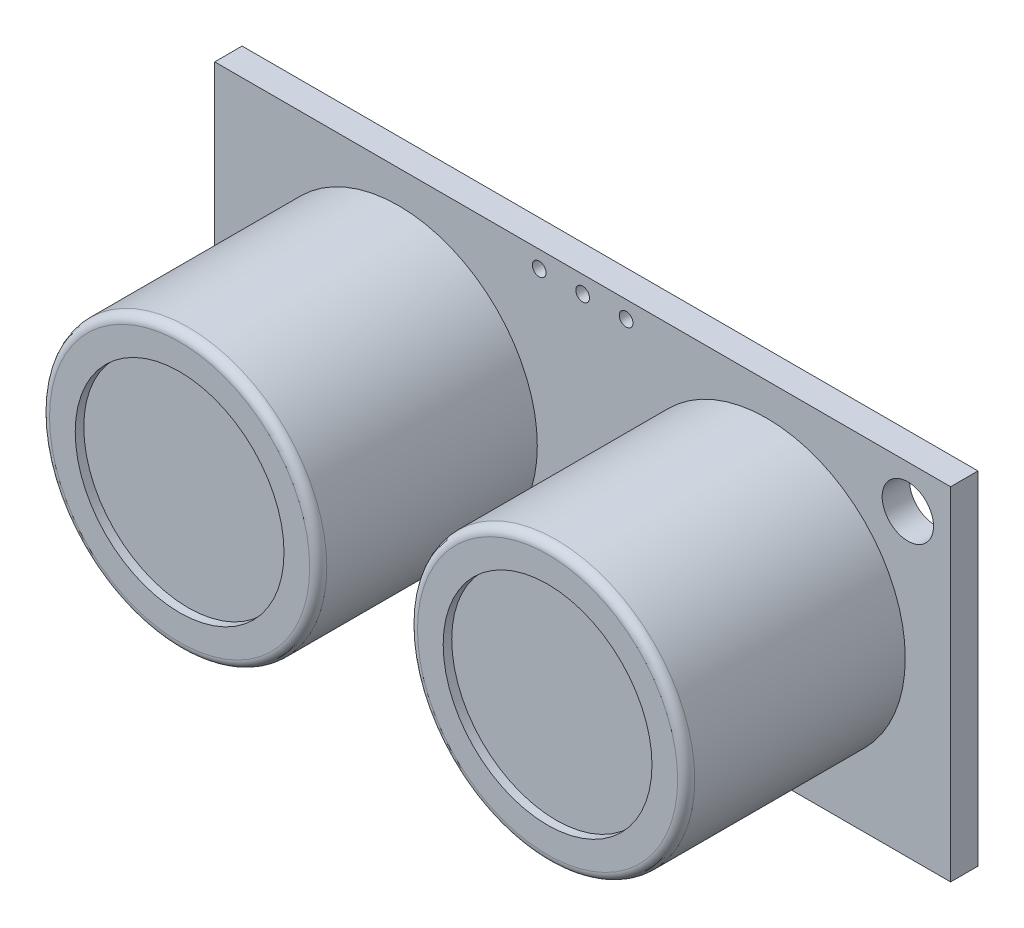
ISO-10303-21;
HEADER;
FILE_DESCRIPTION(('STEP AP214'),'2;1');
FILE_NAME('part.step','',(''),(''),'','','');
FILE_SCHEMA(('AUTOMOTIVE_DESIGN { 1 0 10303 214 1 1 1 1 }'));
ENDSEC;
DATA;
#1=APPLICATION_CONTEXT('core data for automotive mechanical design processes');
#2=APPLICATION_PROTOCOL_DEFINITION('international standard','automotive_design',2000,#1);
#3=PRODUCT_CONTEXT('',#1,'mechanical');
#4=PRODUCT('Part','Part','',(#3));
#5=PRODUCT_RELATED_PRODUCT_CATEGORY('part','',(#4));
#6=PRODUCT_DEFINITION_FORMATION('','',#4);
#7=PRODUCT_DEFINITION_CONTEXT('part definition',#1,'design');
#8=PRODUCT_DEFINITION('design','',#6,#7);
#9=PRODUCT_DEFINITION_SHAPE('','',#8);
#10=(LENGTH_UNIT() NAMED_UNIT(*) SI_UNIT(.MILLI.,.METRE.));
#11=(NAMED_UNIT(*) PLANE_ANGLE_UNIT() SI_UNIT($,.RADIAN.));
#12=(NAMED_UNIT(*) SI_UNIT($,.STERADIAN.) SOLID_ANGLE_UNIT());
#13=UNCERTAINTY_MEASURE_WITH_UNIT(LENGTH_MEASURE(1.E-05),#10,'distance_accuracy_value','');
#14=(GEOMETRIC_REPRESENTATION_CONTEXT(3) GLOBAL_UNCERTAINTY_ASSIGNED_CONTEXT((#13)) GLOBAL_UNIT_ASSIGNED_CONTEXT((#10,
#11,#12)) REPRESENTATION_CONTEXT('',''));
#15=CARTESIAN_POINT('',(0.,0.,0.));
#16=DIRECTION('',(0.,0.,1.));
#17=DIRECTION('',(1.,0.,0.));
#18=AXIS2_PLACEMENT_3D('',#15,#16,#17);
#19=CARTESIAN_POINT('',(10.75,10.,14.4));
#20=DIRECTION('',(0.,0.,1.));
#21=DIRECTION('',(-1.,0.,0.));
#22=AXIS2_PLACEMENT_3D('',#19,#20,#21);
#23=PLANE('',#22);
#24=CARTESIAN_POINT('',(10.75,10.,14.4));
#25=DIRECTION('',(0.,0.,1.));
#26=DIRECTION('',(1.,0.,0.));
#27=AXIS2_PLACEMENT_3D('',#24,#25,#26);
#28=CIRCLE('',#27,7.6);
#29=CARTESIAN_POINT('',(18.35,10.,14.4));
#30=VERTEX_POINT('',#29);
#31=EDGE_CURVE('E11',#30,#30,#28,.T.);
#32=ORIENTED_EDGE('',*,*,#31,.T.);
#33=EDGE_LOOP('',(#32));
#34=FACE_BOUND('',#33,.T.);
#35=CARTESIAN_POINT('',(10.75,10.,14.4));
#36=DIRECTION('',(0.,0.,-1.));
#37=DIRECTION('',(-1.,0.,0.));
#38=AXIS2_PLACEMENT_3D('',#35,#36,#37);
#39=CIRCLE('',#38,6.1);
#40=CARTESIAN_POINT('',(4.64999999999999,10.,14.4));
#41=VERTEX_POINT('',#40);
#42=EDGE_CURVE('E282',#41,#41,#39,.T.);
#43=ORIENTED_EDGE('',*,*,#42,.T.);
#44=EDGE_LOOP('',(#43));
#45=FACE_BOUND('',#44,.T.);
#46=ADVANCED_FACE('F37',(#34,#45),#23,.T.);
#47=CARTESIAN_POINT('',(0.,20.,1.6));
#48=DIRECTION('',(0.,0.,-1.));
#49=DIRECTION('',(-1.,0.,0.));
#50=AXIS2_PLACEMENT_3D('',#47,#48,#49);
#51=PLANE('',#50);
#52=CARTESIAN_POINT('',(10.75,10.,1.6));
#53=DIRECTION('',(0.,0.,-1.));
#54=DIRECTION('',(-1.,0.,0.));
#55=AXIS2_PLACEMENT_3D('',#52,#53,#54);
#56=CIRCLE('',#55,8.1);
#57=CARTESIAN_POINT('',(2.65,10.,1.6));
#58=VERTEX_POINT('',#57);
#59=EDGE_CURVE('E217',#58,#58,#56,.T.);
#60=ORIENTED_EDGE('',*,*,#59,.T.);
#61=EDGE_LOOP('',(#60));
#62=FACE_BOUND('',#61,.T.);
#63=CARTESIAN_POINT('',(24.04,19.,1.6));
#64=DIRECTION('',(0.,0.,1.));
#65=DIRECTION('',(-1.,0.,0.));
#66=AXIS2_PLACEMENT_3D('',#63,#64,#65);
#67=CIRCLE('',#66,0.399999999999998);
#68=CARTESIAN_POINT('',(23.64,19.,1.6));
#69=VERTEX_POINT('',#68);
#70=EDGE_CURVE('E226',#69,#69,#67,.T.);
#71=ORIENTED_EDGE('',*,*,#70,.F.);
#72=EDGE_LOOP('',(#71));
#73=FACE_BOUND('',#72,.T.);
#74=CARTESIAN_POINT('',(21.5,19.,1.6));
#75=DIRECTION('',(0.,0.,1.));
#76=DIRECTION('',(1.,0.,0.));
#77=AXIS2_PLACEMENT_3D('',#74,#75,#76);
#78=CIRCLE('',#77,0.400000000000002);
#79=CARTESIAN_POINT('',(21.9,19.,1.6));
#80=VERTEX_POINT('',#79);
#81=EDGE_CURVE('E238',#80,#80,#78,.T.);
#82=ORIENTED_EDGE('',*,*,#81,.F.);
#83=EDGE_LOOP('',(#82));
#84=FACE_BOUND('',#83,.T.);
#85=CARTESIAN_POINT('',(2.5,2.5,1.6));
#86=DIRECTION('',(0.,0.,1.));
#87=DIRECTION('',(1.,0.,0.));
#88=AXIS2_PLACEMENT_3D('',#85,#86,#87);
#89=CIRCLE('',#88,1.5);
#90=CARTESIAN_POINT('',(4.,2.5,1.6));
#91=VERTEX_POINT('',#90);
#92=EDGE_CURVE('E109',#91,#91,#89,.T.);
#93=ORIENTED_EDGE('',*,*,#92,.F.);
#94=EDGE_LOOP('',(#93));
#95=FACE_BOUND('',#94,.T.);
#96=DIRECTION('',(0.,-1.,0.));
#97=VECTOR('',#96,1.);
#98=CARTESIAN_POINT('',(0.,0.,1.6));
#99=LINE('',#98,#97);
#100=CARTESIAN_POINT('',(0.,20.,1.6));
#101=VERTEX_POINT('',#100);
#102=CARTESIAN_POINT('',(0.,0.,1.6));
#103=VERTEX_POINT('',#102);
#104=EDGE_CURVE('E91',#101,#103,#99,.T.);
#105=ORIENTED_EDGE('',*,*,#104,.T.);
#106=DIRECTION('',(1.,0.,0.));
#107=VECTOR('',#106,1.);
#108=CARTESIAN_POINT('',(0.,0.,1.6));
#109=LINE('',#108,#107);
#110=CARTESIAN_POINT('',(43.,0.,1.6));
#111=VERTEX_POINT('',#110);
#112=EDGE_CURVE('E85',#103,#111,#109,.T.);
#113=ORIENTED_EDGE('',*,*,#112,.T.);
#114=DIRECTION('',(0.,1.,0.));
#115=VECTOR('',#114,1.);
#116=CARTESIAN_POINT('',(43.,0.,1.6));
#117=LINE('',#116,#115);
#118=CARTESIAN_POINT('',(43.,20.,1.6));
#119=VERTEX_POINT('',#118);
#120=EDGE_CURVE('E89',#111,#119,#117,.T.);
#121=ORIENTED_EDGE('',*,*,#120,.T.);
#122=DIRECTION('',(-1.,0.,0.));
#123=VECTOR('',#122,1.);
#124=CARTESIAN_POINT('',(0.,20.,1.6));
#125=LINE('',#124,#123);
#126=EDGE_CURVE('E54',#119,#101,#125,.T.);
#127=ORIENTED_EDGE('',*,*,#126,.T.);
#128=EDGE_LOOP('',(#105,#113,#121,#127));
#129=FACE_BOUND('',#128,.T.);
#130=CARTESIAN_POINT('',(40.5,17.5,1.6));
#131=DIRECTION('',(0.,0.,1.));
#132=DIRECTION('',(1.,0.,0.));
#133=AXIS2_PLACEMENT_3D('',#130,#131,#132);
#134=CIRCLE('',#133,1.5);
#135=CARTESIAN_POINT('',(42.,17.5,1.6));
#136=VERTEX_POINT('',#135);
#137=EDGE_CURVE('E244',#136,#136,#134,.T.);
#138=ORIENTED_EDGE('',*,*,#137,.F.);
#139=EDGE_LOOP('',(#138));
#140=FACE_BOUND('',#139,.T.);
#141=CARTESIAN_POINT('',(18.96,19.,1.6));
#142=DIRECTION('',(0.,0.,1.));
#143=DIRECTION('',(1.,0.,0.));
#144=AXIS2_PLACEMENT_3D('',#141,#142,#143);
#145=CIRCLE('',#144,0.400000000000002);
#146=CARTESIAN_POINT('',(19.36,19.,1.6));
#147=VERTEX_POINT('',#146);
#148=EDGE_CURVE('E232',#147,#147,#145,.T.);
#149=ORIENTED_EDGE('',*,*,#148,.F.);
#150=EDGE_LOOP('',(#149));
#151=FACE_BOUND('',#150,.T.);
#152=CARTESIAN_POINT('',(32.25,10.,1.6));
#153=DIRECTION('',(0.,0.,-1.));
#154=DIRECTION('',(-1.,0.,0.));
#155=AXIS2_PLACEMENT_3D('',#152,#153,#154);
#156=CIRCLE('',#155,8.1);
#157=CARTESIAN_POINT('',(24.15,10.,1.6));
#158=VERTEX_POINT('',#157);
#159=EDGE_CURVE('E116',#158,#158,#156,.F.);
#160=ORIENTED_EDGE('',*,*,#159,.F.);
#161=EDGE_LOOP('',(#160));
#162=FACE_BOUND('',#161,.T.);
#163=ADVANCED_FACE('F86',(#62,#73,#84,#95,#129,#140,#151,#162),#51,.F.);
#164=CARTESIAN_POINT('',(0.,20.,0.));
#165=DIRECTION('',(0.,0.,-1.));
#166=DIRECTION('',(-1.,0.,0.));
#167=AXIS2_PLACEMENT_3D('',#164,#165,#166);
#168=PLANE('',#167);
#169=CARTESIAN_POINT('',(18.96,19.,0.));
#170=DIRECTION('',(0.,0.,1.));
#171=DIRECTION('',(1.,0.,0.));
#172=AXIS2_PLACEMENT_3D('',#169,#170,#171);
#173=CIRCLE('',#172,0.400000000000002);
#174=CARTESIAN_POINT('',(19.36,19.,0.));
#175=VERTEX_POINT('',#174);
#176=EDGE_CURVE('E229',#175,#175,#173,.T.);
#177=ORIENTED_EDGE('',*,*,#176,.T.);
#178=EDGE_LOOP('',(#177));
#179=FACE_BOUND('',#178,.T.);
#180=CARTESIAN_POINT('',(40.5,17.5,0.));
#181=DIRECTION('',(0.,0.,1.));
#182=DIRECTION('',(1.,0.,0.));
#183=AXIS2_PLACEMENT_3D('',#180,#181,#182);
#184=CIRCLE('',#183,1.5);
#185=CARTESIAN_POINT('',(42.,17.5,0.));
#186=VERTEX_POINT('',#185);
#187=EDGE_CURVE('E241',#186,#186,#184,.T.);
#188=ORIENTED_EDGE('',*,*,#187,.T.);
#189=EDGE_LOOP('',(#188));
#190=FACE_BOUND('',#189,.T.);
#191=DIRECTION('',(0.,-1.,0.));
#192=VECTOR('',#191,1.);
#193=CARTESIAN_POINT('',(0.,0.,0.));
#194=LINE('',#193,#192);
#195=CARTESIAN_POINT('',(0.,20.,0.));
#196=VERTEX_POINT('',#195);
#197=CARTESIAN_POINT('',(0.,0.,0.));
#198=VERTEX_POINT('',#197);
#199=EDGE_CURVE('E106',#196,#198,#194,.T.);
#200=ORIENTED_EDGE('',*,*,#199,.F.);
#201=DIRECTION('',(-1.,0.,0.));
#202=VECTOR('',#201,1.);
#203=CARTESIAN_POINT('',(0.,20.,0.));
#204=LINE('',#203,#202);
#205=CARTESIAN_POINT('',(43.,20.,0.));
#206=VERTEX_POINT('',#205);
#207=EDGE_CURVE('E77',#206,#196,#204,.T.);
#208=ORIENTED_EDGE('',*,*,#207,.F.);
#209=DIRECTION('',(0.,1.,0.));
#210=VECTOR('',#209,1.);
#211=CARTESIAN_POINT('',(43.,0.,0.));
#212=LINE('',#211,#210);
#213=CARTESIAN_POINT('',(43.,0.,0.));
#214=VERTEX_POINT('',#213);
#215=EDGE_CURVE('E71',#214,#206,#212,.T.);
#216=ORIENTED_EDGE('',*,*,#215,.F.);
#217=DIRECTION('',(1.,0.,0.));
#218=VECTOR('',#217,1.);
#219=CARTESIAN_POINT('',(0.,0.,0.));
#220=LINE('',#219,#218);
#221=EDGE_CURVE('E96',#198,#214,#220,.T.);
#222=ORIENTED_EDGE('',*,*,#221,.F.);
#223=EDGE_LOOP('',(#200,#208,#216,#222));
#224=FACE_BOUND('',#223,.T.);
#225=CARTESIAN_POINT('',(2.5,2.5,0.));
#226=DIRECTION('',(0.,0.,1.));
#227=DIRECTION('',(1.,0.,0.));
#228=AXIS2_PLACEMENT_3D('',#225,#226,#227);
#229=CIRCLE('',#228,1.5);
#230=CARTESIAN_POINT('',(4.,2.5,0.));
#231=VERTEX_POINT('',#230);
#232=EDGE_CURVE('E247',#231,#231,#229,.T.);
#233=ORIENTED_EDGE('',*,*,#232,.T.);
#234=EDGE_LOOP('',(#233));
#235=FACE_BOUND('',#234,.T.);
#236=CARTESIAN_POINT('',(21.5,19.,0.));
#237=DIRECTION('',(0.,0.,1.));
#238=DIRECTION('',(1.,0.,0.));
#239=AXIS2_PLACEMENT_3D('',#236,#237,#238);
#240=CIRCLE('',#239,0.400000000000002);
#241=CARTESIAN_POINT('',(21.9,19.,0.));
#242=VERTEX_POINT('',#241);
#243=EDGE_CURVE('E235',#242,#242,#240,.T.);
#244=ORIENTED_EDGE('',*,*,#243,.T.);
#245=EDGE_LOOP('',(#244));
#246=FACE_BOUND('',#245,.T.);
#247=CARTESIAN_POINT('',(24.04,19.,0.));
#248=DIRECTION('',(0.,0.,1.));
#249=DIRECTION('',(-1.,0.,0.));
#250=AXIS2_PLACEMENT_3D('',#247,#248,#249);
#251=CIRCLE('',#250,0.399999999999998);
#252=CARTESIAN_POINT('',(23.64,19.,0.));
#253=VERTEX_POINT('',#252);
#254=EDGE_CURVE('E220',#253,#253,#251,.T.);
#255=ORIENTED_EDGE('',*,*,#254,.T.);
#256=EDGE_LOOP('',(#255));
#257=FACE_BOUND('',#256,.T.);
#258=ADVANCED_FACE('F146',(#179,#190,#224,#235,#246,#257),#168,.T.);
#259=CARTESIAN_POINT('',(0.,0.,1.6));
#260=DIRECTION('',(1.,0.,0.));
#261=DIRECTION('',(0.,0.,-1.));
#262=AXIS2_PLACEMENT_3D('',#259,#260,#261);
#263=PLANE('',#262);
#264=ORIENTED_EDGE('',*,*,#199,.T.);
#265=DIRECTION('',(0.,0.,-1.));
#266=VECTOR('',#265,1.);
#267=CARTESIAN_POINT('',(0.,0.,1.6));
#268=LINE('',#267,#266);
#269=EDGE_CURVE('E97',#103,#198,#268,.T.);
#270=ORIENTED_EDGE('',*,*,#269,.F.);
#271=ORIENTED_EDGE('',*,*,#104,.F.);
#272=DIRECTION('',(0.,0.,-1.));
#273=VECTOR('',#272,1.);
#274=CARTESIAN_POINT('',(0.,20.,1.6));
#275=LINE('',#274,#273);
#276=EDGE_CURVE('E102',#101,#196,#275,.T.);
#277=ORIENTED_EDGE('',*,*,#276,.T.);
#278=EDGE_LOOP('',(#264,#270,#271,#277));
#279=FACE_BOUND('',#278,.T.);
#280=ADVANCED_FACE('F194',(#279),#263,.F.);
#281=CARTESIAN_POINT('',(0.,0.,1.6));
#282=DIRECTION('',(0.,1.,0.));
#283=DIRECTION('',(0.,0.,1.));
#284=AXIS2_PLACEMENT_3D('',#281,#282,#283);
#285=PLANE('',#284);
#286=ORIENTED_EDGE('',*,*,#221,.T.);
#287=DIRECTION('',(0.,0.,-1.));
#288=VECTOR('',#287,1.);
#289=CARTESIAN_POINT('',(43.,0.,1.6));
#290=LINE('',#289,#288);
#291=EDGE_CURVE('E94',#111,#214,#290,.T.);
#292=ORIENTED_EDGE('',*,*,#291,.F.);
#293=ORIENTED_EDGE('',*,*,#112,.F.);
#294=ORIENTED_EDGE('',*,*,#269,.T.);
#295=EDGE_LOOP('',(#286,#292,#293,#294));
#296=FACE_BOUND('',#295,.T.);
#297=ADVANCED_FACE('F95',(#296),#285,.F.);
#298=CARTESIAN_POINT('',(43.,0.,1.6));
#299=DIRECTION('',(-1.,0.,0.));
#300=DIRECTION('',(0.,0.,1.));
#301=AXIS2_PLACEMENT_3D('',#298,#299,#300);
#302=PLANE('',#301);
#303=ORIENTED_EDGE('',*,*,#215,.T.);
#304=DIRECTION('',(0.,0.,-1.));
#305=VECTOR('',#304,1.);
#306=CARTESIAN_POINT('',(43.,20.,1.6));
#307=LINE('',#306,#305);
#308=EDGE_CURVE('E98',#119,#206,#307,.T.);
#309=ORIENTED_EDGE('',*,*,#308,.F.);
#310=ORIENTED_EDGE('',*,*,#120,.F.);
#311=ORIENTED_EDGE('',*,*,#291,.T.);
#312=EDGE_LOOP('',(#303,#309,#310,#311));
#313=FACE_BOUND('',#312,.T.);
#314=ADVANCED_FACE('F100',(#313),#302,.F.);
#315=CARTESIAN_POINT('',(0.,20.,1.6));
#316=DIRECTION('',(0.,-1.,0.));
#317=DIRECTION('',(0.,0.,-1.));
#318=AXIS2_PLACEMENT_3D('',#315,#316,#317);
#319=PLANE('',#318);
#320=ORIENTED_EDGE('',*,*,#207,.T.);
#321=ORIENTED_EDGE('',*,*,#276,.F.);
#322=ORIENTED_EDGE('',*,*,#126,.F.);
#323=ORIENTED_EDGE('',*,*,#308,.T.);
#324=EDGE_LOOP('',(#320,#321,#322,#323));
#325=FACE_BOUND('',#324,.T.);
#326=ADVANCED_FACE('F189',(#325),#319,.F.);
#327=CARTESIAN_POINT('',(2.5,2.5,1.6));
#328=DIRECTION('',(0.,0.,-1.));
#329=DIRECTION('',(-1.,0.,0.));
#330=AXIS2_PLACEMENT_3D('',#327,#328,#329);
#331=CYLINDRICAL_SURFACE('',#330,1.5);
#332=ORIENTED_EDGE('',*,*,#92,.T.);
#333=EDGE_LOOP('',(#332));
#334=FACE_BOUND('',#333,.T.);
#335=ORIENTED_EDGE('',*,*,#232,.F.);
#336=EDGE_LOOP('',(#335));
#337=FACE_BOUND('',#336,.T.);
#338=ADVANCED_FACE('F186',(#334,#337),#331,.F.);
#339=CARTESIAN_POINT('',(40.5,17.5,1.6));
#340=DIRECTION('',(0.,0.,-1.));
#341=DIRECTION('',(-1.,0.,0.));
#342=AXIS2_PLACEMENT_3D('',#339,#340,#341);
#343=CYLINDRICAL_SURFACE('',#342,1.5);
#344=ORIENTED_EDGE('',*,*,#137,.T.);
#345=EDGE_LOOP('',(#344));
#346=FACE_BOUND('',#345,.T.);
#347=ORIENTED_EDGE('',*,*,#187,.F.);
#348=EDGE_LOOP('',(#347));
#349=FACE_BOUND('',#348,.T.);
#350=ADVANCED_FACE('F182',(#346,#349),#343,.F.);
#351=CARTESIAN_POINT('',(21.5,19.,1.6));
#352=DIRECTION('',(0.,0.,-1.));
#353=DIRECTION('',(-1.,0.,0.));
#354=AXIS2_PLACEMENT_3D('',#351,#352,#353);
#355=CYLINDRICAL_SURFACE('',#354,0.400000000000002);
#356=ORIENTED_EDGE('',*,*,#81,.T.);
#357=EDGE_LOOP('',(#356));
#358=FACE_BOUND('',#357,.T.);
#359=ORIENTED_EDGE('',*,*,#243,.F.);
#360=EDGE_LOOP('',(#359));
#361=FACE_BOUND('',#360,.T.);
#362=ADVANCED_FACE('F178',(#358,#361),#355,.F.);
#363=CARTESIAN_POINT('',(18.96,19.,1.6));
#364=DIRECTION('',(0.,0.,-1.));
#365=DIRECTION('',(-1.,0.,0.));
#366=AXIS2_PLACEMENT_3D('',#363,#364,#365);
#367=CYLINDRICAL_SURFACE('',#366,0.400000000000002);
#368=ORIENTED_EDGE('',*,*,#148,.T.);
#369=EDGE_LOOP('',(#368));
#370=FACE_BOUND('',#369,.T.);
#371=ORIENTED_EDGE('',*,*,#176,.F.);
#372=EDGE_LOOP('',(#371));
#373=FACE_BOUND('',#372,.T.);
#374=ADVANCED_FACE('F174',(#370,#373),#367,.F.);
#375=CARTESIAN_POINT('',(24.04,19.,1.6));
#376=DIRECTION('',(0.,0.,-1.));
#377=DIRECTION('',(-1.,0.,0.));
#378=AXIS2_PLACEMENT_3D('',#375,#376,#377);
#379=CYLINDRICAL_SURFACE('',#378,0.399999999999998);
#380=ORIENTED_EDGE('',*,*,#70,.T.);
#381=EDGE_LOOP('',(#380));
#382=FACE_BOUND('',#381,.T.);
#383=ORIENTED_EDGE('',*,*,#254,.F.);
#384=EDGE_LOOP('',(#383));
#385=FACE_BOUND('',#384,.T.);
#386=ADVANCED_FACE('F170',(#382,#385),#379,.F.);
#387=CARTESIAN_POINT('',(32.25,10.,14.4));
#388=DIRECTION('',(0.,0.,-1.));
#389=DIRECTION('',(-1.,0.,0.));
#390=AXIS2_PLACEMENT_3D('',#387,#388,#389);
#391=CYLINDRICAL_SURFACE('',#390,8.1);
#392=CARTESIAN_POINT('',(32.25,10.,13.9));
#393=DIRECTION('',(0.,0.,1.));
#394=DIRECTION('',(1.,0.,0.));
#395=AXIS2_PLACEMENT_3D('',#392,#393,#394);
#396=CIRCLE('',#395,8.1);
#397=CARTESIAN_POINT('',(40.35,10.,13.9));
#398=VERTEX_POINT('',#397);
#399=EDGE_CURVE('E122',#398,#398,#396,.F.);
#400=ORIENTED_EDGE('',*,*,#399,.T.);
#401=EDGE_LOOP('',(#400));
#402=FACE_BOUND('',#401,.T.);
#403=ORIENTED_EDGE('',*,*,#159,.T.);
#404=EDGE_LOOP('',(#403));
#405=FACE_BOUND('',#404,.T.);
#406=ADVANCED_FACE('F166',(#402,#405),#391,.T.);
#407=CARTESIAN_POINT('',(32.25,10.,14.4));
#408=DIRECTION('',(0.,0.,1.));
#409=DIRECTION('',(1.,0.,0.));
#410=AXIS2_PLACEMENT_3D('',#407,#408,#409);
#411=PLANE('',#410);
#412=CARTESIAN_POINT('',(32.25,10.,14.4));
#413=DIRECTION('',(0.,0.,1.));
#414=DIRECTION('',(1.,0.,0.));
#415=AXIS2_PLACEMENT_3D('',#412,#413,#414);
#416=CIRCLE('',#415,7.6);
#417=CARTESIAN_POINT('',(39.85,10.,14.4));
#418=VERTEX_POINT('',#417);
#419=EDGE_CURVE('E119',#418,#418,#416,.T.);
#420=ORIENTED_EDGE('',*,*,#419,.T.);
#421=EDGE_LOOP('',(#420));
#422=FACE_BOUND('',#421,.T.);
#423=CARTESIAN_POINT('',(32.25,10.,14.4));
#424=DIRECTION('',(0.,0.,1.));
#425=DIRECTION('',(1.,0.,0.));
#426=AXIS2_PLACEMENT_3D('',#423,#424,#425);
#427=CIRCLE('',#426,6.1);
#428=CARTESIAN_POINT('',(38.35,10.,14.4));
#429=VERTEX_POINT('',#428);
#430=EDGE_CURVE('E214',#429,#429,#427,.T.);
#431=ORIENTED_EDGE('',*,*,#430,.F.);
#432=EDGE_LOOP('',(#431));
#433=FACE_BOUND('',#432,.T.);
#434=ADVANCED_FACE('F162',(#422,#433),#411,.T.);
#435=CARTESIAN_POINT('',(32.25,10.,13.9));
#436=DIRECTION('',(0.,0.,1.));
#437=DIRECTION('',(1.,0.,0.));
#438=AXIS2_PLACEMENT_3D('',#435,#436,#437);
#439=CYLINDRICAL_SURFACE('',#438,6.1);
#440=CARTESIAN_POINT('',(32.25,10.,13.9));
#441=DIRECTION('',(0.,0.,1.));
#442=DIRECTION('',(1.,0.,0.));
#443=AXIS2_PLACEMENT_3D('',#440,#441,#442);
#444=CIRCLE('',#443,6.1);
#445=CARTESIAN_POINT('',(38.35,10.,13.9));
#446=VERTEX_POINT('',#445);
#447=EDGE_CURVE('E216',#446,#446,#444,.T.);
#448=ORIENTED_EDGE('',*,*,#447,.F.);
#449=EDGE_LOOP('',(#448));
#450=FACE_BOUND('',#449,.T.);
#451=ORIENTED_EDGE('',*,*,#430,.T.);
#452=EDGE_LOOP('',(#451));
#453=FACE_BOUND('',#452,.T.);
#454=ADVANCED_FACE('F158',(#450,#453),#439,.F.);
#455=CARTESIAN_POINT('',(32.25,10.,13.9));
#456=DIRECTION('',(0.,0.,1.));
#457=DIRECTION('',(1.,0.,0.));
#458=AXIS2_PLACEMENT_3D('',#455,#456,#457);
#459=PLANE('',#458);
#460=ORIENTED_EDGE('',*,*,#447,.T.);
#461=EDGE_LOOP('',(#460));
#462=FACE_BOUND('',#461,.T.);
#463=ADVANCED_FACE('F155',(#462),#459,.T.);
#464=CARTESIAN_POINT('',(32.25,10.,13.9));
#465=DIRECTION('',(0.,0.,1.));
#466=DIRECTION('',(1.,0.,0.));
#467=AXIS2_PLACEMENT_3D('',#464,#465,#466);
#468=TOROIDAL_SURFACE('',#467,7.6,0.5);
#469=ORIENTED_EDGE('',*,*,#399,.F.);
#470=EDGE_LOOP('',(#469));
#471=FACE_BOUND('',#470,.T.);
#472=ORIENTED_EDGE('',*,*,#419,.F.);
#473=EDGE_LOOP('',(#472));
#474=FACE_BOUND('',#473,.T.);
#475=ADVANCED_FACE('F154',(#471,#474),#468,.T.);
#476=CARTESIAN_POINT('',(10.75,10.,14.4));
#477=DIRECTION('',(0.,0.,-1.));
#478=DIRECTION('',(-1.,0.,0.));
#479=AXIS2_PLACEMENT_3D('',#476,#477,#478);
#480=CYLINDRICAL_SURFACE('',#479,8.1);
#481=CARTESIAN_POINT('',(10.75,10.,13.9));
#482=DIRECTION('',(0.,0.,1.));
#483=DIRECTION('',(1.,0.,0.));
#484=AXIS2_PLACEMENT_3D('',#481,#482,#483);
#485=CIRCLE('',#484,8.1);
#486=CARTESIAN_POINT('',(18.85,10.,13.9));
#487=VERTEX_POINT('',#486);
#488=EDGE_CURVE('E46',#487,#487,#485,.F.);
#489=ORIENTED_EDGE('',*,*,#488,.T.);
#490=EDGE_LOOP('',(#489));
#491=FACE_BOUND('',#490,.T.);
#492=ORIENTED_EDGE('',*,*,#59,.F.);
#493=EDGE_LOOP('',(#492));
#494=FACE_BOUND('',#493,.T.);
#495=ADVANCED_FACE('F127',(#491,#494),#480,.T.);
#496=CARTESIAN_POINT('',(10.75,10.,13.9));
#497=DIRECTION('',(0.,0.,1.));
#498=DIRECTION('',(1.,0.,0.));
#499=AXIS2_PLACEMENT_3D('',#496,#497,#498);
#500=CYLINDRICAL_SURFACE('',#499,6.1);
#501=CARTESIAN_POINT('',(10.75,10.,13.9));
#502=DIRECTION('',(0.,0.,-1.));
#503=DIRECTION('',(-1.,0.,0.));
#504=AXIS2_PLACEMENT_3D('',#501,#502,#503);
#505=CIRCLE('',#504,6.1);
#506=CARTESIAN_POINT('',(4.64999999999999,10.,13.9));
#507=VERTEX_POINT('',#506);
#508=EDGE_CURVE('E223',#507,#507,#505,.T.);
#509=ORIENTED_EDGE('',*,*,#508,.T.);
#510=EDGE_LOOP('',(#509));
#511=FACE_BOUND('',#510,.T.);
#512=ORIENTED_EDGE('',*,*,#42,.F.);
#513=EDGE_LOOP('',(#512));
#514=FACE_BOUND('',#513,.T.);
#515=ADVANCED_FACE('F136',(#511,#514),#500,.F.);
#516=CARTESIAN_POINT('',(10.75,10.,13.9));
#517=DIRECTION('',(0.,0.,1.));
#518=DIRECTION('',(-1.,0.,0.));
#519=AXIS2_PLACEMENT_3D('',#516,#517,#518);
#520=PLANE('',#519);
#521=ORIENTED_EDGE('',*,*,#508,.F.);
#522=EDGE_LOOP('',(#521));
#523=FACE_BOUND('',#522,.T.);
#524=ADVANCED_FACE('F131',(#523),#520,.T.);
#525=CARTESIAN_POINT('',(10.75,10.,13.9));
#526=DIRECTION('',(0.,0.,1.));
#527=DIRECTION('',(1.,0.,0.));
#528=AXIS2_PLACEMENT_3D('',#525,#526,#527);
#529=TOROIDAL_SURFACE('',#528,7.6,0.5);
#530=ORIENTED_EDGE('',*,*,#31,.F.);
#531=EDGE_LOOP('',(#530));
#532=FACE_BOUND('',#531,.T.);
#533=ORIENTED_EDGE('',*,*,#488,.F.);
#534=EDGE_LOOP('',(#533));
#535=FACE_BOUND('',#534,.T.);
#536=ADVANCED_FACE('F39',(#532,#535),#529,.T.);
#537=CLOSED_SHELL('',(#46,#163,#258,#280,#297,#314,#326,#338,#350,#362,#374,#386,#406,#434,#454,
#463,#475,#495,#515,#524,#536));
#538=MANIFOLD_SOLID_BREP('B2',#537);
#539=ADVANCED_BREP_SHAPE_REPRESENTATION('',(#18,#538),#14);
#540=SHAPE_DEFINITION_REPRESENTATION(#9,#539);
ENDSEC;
END-ISO-10303-21;
